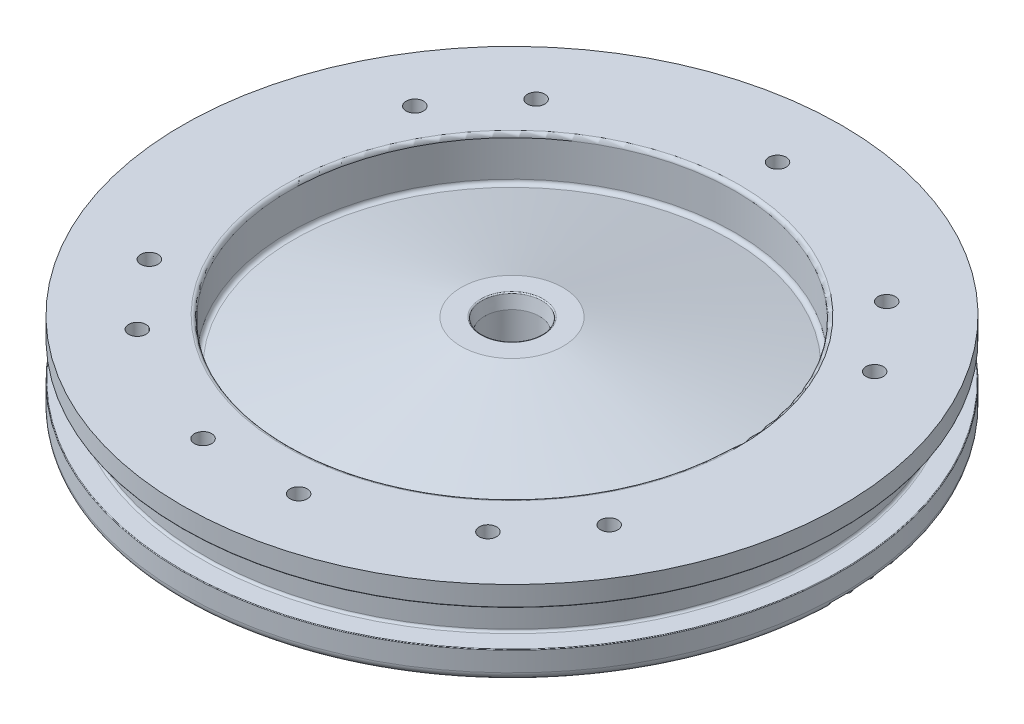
ISO-10303-21;
HEADER;
FILE_DESCRIPTION(('STEP AP214'),'2;1');
FILE_NAME('part.step','',(''),(''),'','','');
FILE_SCHEMA(('AUTOMOTIVE_DESIGN { 1 0 10303 214 1 1 1 1 }'));
ENDSEC;
DATA;
#1=APPLICATION_CONTEXT('core data for automotive mechanical design processes');
#2=APPLICATION_PROTOCOL_DEFINITION('international standard','automotive_design',2000,#1);
#3=PRODUCT_CONTEXT('',#1,'mechanical');
#4=PRODUCT('Part','Part','',(#3));
#5=PRODUCT_RELATED_PRODUCT_CATEGORY('part','',(#4));
#6=PRODUCT_DEFINITION_FORMATION('','',#4);
#7=PRODUCT_DEFINITION_CONTEXT('part definition',#1,'design');
#8=PRODUCT_DEFINITION('design','',#6,#7);
#9=PRODUCT_DEFINITION_SHAPE('','',#8);
#10=(LENGTH_UNIT() NAMED_UNIT(*) SI_UNIT(.MILLI.,.METRE.));
#11=(NAMED_UNIT(*) PLANE_ANGLE_UNIT() SI_UNIT($,.RADIAN.));
#12=(NAMED_UNIT(*) SI_UNIT($,.STERADIAN.) SOLID_ANGLE_UNIT());
#13=UNCERTAINTY_MEASURE_WITH_UNIT(LENGTH_MEASURE(1.E-05),#10,'distance_accuracy_value','');
#14=(GEOMETRIC_REPRESENTATION_CONTEXT(3) GLOBAL_UNCERTAINTY_ASSIGNED_CONTEXT((#13)) GLOBAL_UNIT_ASSIGNED_CONTEXT((#10,
#11,#12)) REPRESENTATION_CONTEXT('',''));
#15=CARTESIAN_POINT('',(0.,0.,0.));
#16=DIRECTION('',(0.,0.,1.));
#17=DIRECTION('',(1.,0.,0.));
#18=AXIS2_PLACEMENT_3D('',#15,#16,#17);
#19=CARTESIAN_POINT('',(0.,-11.34745,0.));
#20=DIRECTION('',(0.,-1.,0.));
#21=DIRECTION('',(0.,0.,-1.));
#22=AXIS2_PLACEMENT_3D('',#19,#20,#21);
#23=TOROIDAL_SURFACE('',#22,65.532,0.127000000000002);
#24=CARTESIAN_POINT('',(0.,-11.34745,0.));
#25=DIRECTION('',(0.,-1.,0.));
#26=DIRECTION('',(0.,0.,-1.));
#27=AXIS2_PLACEMENT_3D('',#24,#25,#26);
#28=CIRCLE('',#27,65.659);
#29=CARTESIAN_POINT('',(0.,-11.34745,-65.659));
#30=VERTEX_POINT('',#29);
#31=EDGE_CURVE('E235',#30,#30,#28,.T.);
#32=ORIENTED_EDGE('',*,*,#31,.F.);
#33=EDGE_LOOP('',(#32));
#34=FACE_BOUND('',#33,.T.);
#35=CARTESIAN_POINT('',(0.,-11.22045,0.));
#36=DIRECTION('',(0.,-1.,0.));
#37=DIRECTION('',(0.,0.,-1.));
#38=AXIS2_PLACEMENT_3D('',#35,#36,#37);
#39=CIRCLE('',#38,65.532);
#40=CARTESIAN_POINT('',(0.,-11.22045,-65.532));
#41=VERTEX_POINT('',#40);
#42=EDGE_CURVE('E191',#41,#41,#39,.T.);
#43=ORIENTED_EDGE('',*,*,#42,.T.);
#44=EDGE_LOOP('',(#43));
#45=FACE_BOUND('',#44,.T.);
#46=ADVANCED_FACE('F45',(#34,#45),#23,.T.);
#47=CARTESIAN_POINT('',(0.,-8.89,0.));
#48=DIRECTION('',(0.,-1.,0.));
#49=DIRECTION('',(0.,0.,-1.));
#50=AXIS2_PLACEMENT_3D('',#47,#48,#49);
#51=CYLINDRICAL_SURFACE('',#50,65.659);
#52=CARTESIAN_POINT('',(0.,-15.24,0.));
#53=DIRECTION('',(0.,-1.,0.));
#54=DIRECTION('',(0.,0.,-1.));
#55=AXIS2_PLACEMENT_3D('',#52,#53,#54);
#56=CIRCLE('',#55,65.659);
#57=CARTESIAN_POINT('',(0.,-15.24,-65.659));
#58=VERTEX_POINT('',#57);
#59=EDGE_CURVE('E231',#58,#58,#56,.T.);
#60=ORIENTED_EDGE('',*,*,#59,.F.);
#61=EDGE_LOOP('',(#60));
#62=FACE_BOUND('',#61,.T.);
#63=ORIENTED_EDGE('',*,*,#31,.T.);
#64=EDGE_LOOP('',(#63));
#65=FACE_BOUND('',#64,.T.);
#66=ADVANCED_FACE('F284',(#62,#65),#51,.T.);
#67=CARTESIAN_POINT('',(0.,-15.24,0.));
#68=DIRECTION('',(0.,-1.,0.));
#69=DIRECTION('',(0.,0.,-1.));
#70=AXIS2_PLACEMENT_3D('',#67,#68,#69);
#71=TOROIDAL_SURFACE('',#70,64.0715,1.5875);
#72=CARTESIAN_POINT('',(0.,-16.8275,0.));
#73=DIRECTION('',(0.,-1.,0.));
#74=DIRECTION('',(0.,0.,-1.));
#75=AXIS2_PLACEMENT_3D('',#72,#73,#74);
#76=CIRCLE('',#75,64.0715);
#77=CARTESIAN_POINT('',(0.,-16.8275,-64.0715));
#78=VERTEX_POINT('',#77);
#79=EDGE_CURVE('E227',#78,#78,#76,.T.);
#80=ORIENTED_EDGE('',*,*,#79,.F.);
#81=EDGE_LOOP('',(#80));
#82=FACE_BOUND('',#81,.T.);
#83=ORIENTED_EDGE('',*,*,#59,.T.);
#84=EDGE_LOOP('',(#83));
#85=FACE_BOUND('',#84,.T.);
#86=ADVANCED_FACE('F290',(#82,#85),#71,.T.);
#87=CARTESIAN_POINT('',(-64.0715,-16.8275,0.));
#88=DIRECTION('',(0.,1.,0.));
#89=DIRECTION('',(0.,0.,1.));
#90=AXIS2_PLACEMENT_3D('',#87,#88,#89);
#91=PLANE('',#90);
#92=CARTESIAN_POINT('',(0.,-16.8275,0.));
#93=DIRECTION('',(0.,-1.,0.));
#94=DIRECTION('',(0.,0.,-1.));
#95=AXIS2_PLACEMENT_3D('',#92,#93,#94);
#96=CIRCLE('',#95,59.309);
#97=CARTESIAN_POINT('',(0.,-16.8275,-59.309));
#98=VERTEX_POINT('',#97);
#99=EDGE_CURVE('E223',#98,#98,#96,.T.);
#100=ORIENTED_EDGE('',*,*,#99,.F.);
#101=EDGE_LOOP('',(#100));
#102=FACE_BOUND('',#101,.T.);
#103=ORIENTED_EDGE('',*,*,#79,.T.);
#104=EDGE_LOOP('',(#103));
#105=FACE_BOUND('',#104,.T.);
#106=ADVANCED_FACE('F298',(#102,#105),#91,.F.);
#107=CARTESIAN_POINT('',(0.,-16.8275,0.));
#108=DIRECTION('',(0.,-1.,0.));
#109=DIRECTION('',(0.,0.,-1.));
#110=AXIS2_PLACEMENT_3D('',#107,#108,#109);
#111=CONICAL_SURFACE('',#110,59.309,1.43775391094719);
#112=CARTESIAN_POINT('',(0.,-9.63360947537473,0.));
#113=DIRECTION('',(0.,-1.,0.));
#114=DIRECTION('',(0.,0.,-1.));
#115=AXIS2_PLACEMENT_3D('',#112,#113,#114);
#116=CIRCLE('',#115,5.55625);
#117=CARTESIAN_POINT('',(0.,-9.63360947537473,-5.55624999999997));
#118=VERTEX_POINT('',#117);
#119=EDGE_CURVE('E49',#118,#118,#116,.F.);
#120=CARTESIAN_POINT('',(0.,-9.63360947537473,-5.55624999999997));
#121=CARTESIAN_POINT('',(0.,-9.70854583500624,-6.11617447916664));
#122=CARTESIAN_POINT('',(0.,-9.78348219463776,-6.67609895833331));
#123=CARTESIAN_POINT('',(0.,-9.93335491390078,-7.79594791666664));
#124=CARTESIAN_POINT('',(0.,-10.0082912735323,-8.35587239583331));
#125=CARTESIAN_POINT('',(0.,-10.1581639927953,-9.47572135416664));
#126=CARTESIAN_POINT('',(0.,-10.2331003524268,-10.0356458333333));
#127=CARTESIAN_POINT('',(0.,-10.3829730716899,-11.1554947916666));
#128=CARTESIAN_POINT('',(0.,-10.4579094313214,-11.7154192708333));
#129=CARTESIAN_POINT('',(0.,-10.6077821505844,-12.8352682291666));
#130=CARTESIAN_POINT('',(0.,-10.6827185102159,-13.3951927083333));
#131=CARTESIAN_POINT('',(0.,-10.8325912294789,-14.5150416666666));
#132=CARTESIAN_POINT('',(0.,-10.9075275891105,-15.0749661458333));
#133=CARTESIAN_POINT('',(0.,-11.0574003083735,-16.1948151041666));
#134=CARTESIAN_POINT('',(0.,-11.132336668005,-16.7547395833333));
#135=CARTESIAN_POINT('',(0.,-11.282209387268,-17.8745885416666));
#136=CARTESIAN_POINT('',(0.,-11.3571457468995,-18.4345130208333));
#137=CARTESIAN_POINT('',(0.,-11.5070184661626,-19.5543619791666));
#138=CARTESIAN_POINT('',(0.,-11.5819548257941,-20.1142864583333));
#139=CARTESIAN_POINT('',(0.,-11.7318275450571,-21.2341354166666));
#140=CARTESIAN_POINT('',(0.,-11.8067639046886,-21.7940598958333));
#141=CARTESIAN_POINT('',(0.,-11.9566366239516,-22.9139088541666));
#142=CARTESIAN_POINT('',(0.,-12.0315729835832,-23.4738333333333));
#143=CARTESIAN_POINT('',(0.,-12.1814457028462,-24.5936822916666));
#144=CARTESIAN_POINT('',(0.,-12.2563820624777,-25.1536067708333));
#145=CARTESIAN_POINT('',(0.,-12.4062547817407,-26.2734557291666));
#146=CARTESIAN_POINT('',(0.,-12.4811911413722,-26.8333802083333));
#147=CARTESIAN_POINT('',(0.,-12.6310638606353,-27.9532291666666));
#148=CARTESIAN_POINT('',(0.,-12.7060002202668,-28.5131536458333));
#149=CARTESIAN_POINT('',(0.,-12.8558729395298,-29.6330026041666));
#150=CARTESIAN_POINT('',(0.,-12.9308092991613,-30.1929270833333));
#151=CARTESIAN_POINT('',(0.,-13.0806820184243,-31.3127760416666));
#152=CARTESIAN_POINT('',(0.,-13.1556183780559,-31.8727005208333));
#153=CARTESIAN_POINT('',(0.,-13.3054910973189,-32.9925494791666));
#154=CARTESIAN_POINT('',(0.,-13.3804274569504,-33.5524739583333));
#155=CARTESIAN_POINT('',(0.,-13.5303001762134,-34.6723229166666));
#156=CARTESIAN_POINT('',(0.,-13.6052365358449,-35.2322473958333));
#157=CARTESIAN_POINT('',(0.,-13.755109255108,-36.3520963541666));
#158=CARTESIAN_POINT('',(0.,-13.8300456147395,-36.9120208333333));
#159=CARTESIAN_POINT('',(0.,-13.9799183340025,-38.0318697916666));
#160=CARTESIAN_POINT('',(0.,-14.054854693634,-38.5917942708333));
#161=CARTESIAN_POINT('',(0.,-14.204727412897,-39.7116432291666));
#162=CARTESIAN_POINT('',(0.,-14.2796637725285,-40.2715677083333));
#163=CARTESIAN_POINT('',(0.,-14.4295364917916,-41.3914166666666));
#164=CARTESIAN_POINT('',(0.,-14.5044728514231,-41.9513411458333));
#165=CARTESIAN_POINT('',(0.,-14.6543455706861,-43.0711901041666));
#166=CARTESIAN_POINT('',(0.,-14.7292819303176,-43.6311145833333));
#167=CARTESIAN_POINT('',(0.,-14.8791546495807,-44.7509635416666));
#168=CARTESIAN_POINT('',(0.,-14.9540910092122,-45.3108880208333));
#169=CARTESIAN_POINT('',(0.,-15.1039637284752,-46.4307369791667));
#170=CARTESIAN_POINT('',(0.,-15.1789000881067,-46.9906614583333));
#171=CARTESIAN_POINT('',(0.,-15.3287728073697,-48.1105104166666));
#172=CARTESIAN_POINT('',(0.,-15.4037091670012,-48.6704348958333));
#173=CARTESIAN_POINT('',(0.,-15.5535818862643,-49.7902838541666));
#174=CARTESIAN_POINT('',(0.,-15.6285182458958,-50.3502083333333));
#175=CARTESIAN_POINT('',(0.,-15.7783909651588,-51.4700572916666));
#176=CARTESIAN_POINT('',(0.,-15.8533273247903,-52.0299817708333));
#177=CARTESIAN_POINT('',(0.,-16.0032000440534,-53.1498307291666));
#178=CARTESIAN_POINT('',(0.,-16.0781364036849,-53.7097552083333));
#179=CARTESIAN_POINT('',(0.,-16.2280091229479,-54.8296041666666));
#180=CARTESIAN_POINT('',(0.,-16.3029454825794,-55.3895286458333));
#181=CARTESIAN_POINT('',(0.,-16.4528182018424,-56.5093776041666));
#182=CARTESIAN_POINT('',(0.,-16.5277545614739,-57.0693020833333));
#183=CARTESIAN_POINT('',(0.,-16.677627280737,-58.1891510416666));
#184=CARTESIAN_POINT('',(0.,-16.7525636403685,-58.7490755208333));
#185=CARTESIAN_POINT('',(0.,-16.8275,-59.309));
#186=B_SPLINE_CURVE_WITH_KNOTS('',3,(#120,#121,#122,#123,#124,#125,#126,#127,#128,#129,#130,
#131,#132,#133,#134,#135,#136,#137,#138,#139,#140,#141,#142,#143,#144,#145,#146,#147,#148,#149,
#150,#151,#152,#153,#154,#155,#156,#157,#158,#159,#160,#161,#162,#163,#164,#165,#166,#167,#168,
#169,#170,#171,#172,#173,#174,#175,#176,#177,#178,#179,#180,#181,#182,#183,#184,#185),
.UNSPECIFIED.,.F.,.F.,(4,2,2,2,2,2,2,2,2,2,2,2,2,2,2,2,2,2,2,2,2,2,2,2,2,2,2,2,2,2,2,2,4),(0.,
1.69475010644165,3.3895002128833,5.08425031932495,6.7790004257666,8.47375053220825,
10.1685006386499,11.8632507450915,13.5580008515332,15.2527509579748,16.9475010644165,
18.6422511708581,20.3370012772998,22.0317513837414,23.7265014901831,25.4212515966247,
27.1160017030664,28.810751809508,30.5055019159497,32.2002520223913,33.895002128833,
35.5897522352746,37.2845023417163,38.9792524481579,40.6740025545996,42.3687526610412,
44.0635027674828,45.7582528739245,47.4530029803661,49.1477530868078,50.8425031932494,
52.5372532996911,54.2320034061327),.UNSPECIFIED.);
#187=EDGE_CURVE('BSEAM302',#118,#98,#186,.T.);
#188=ORIENTED_EDGE('',*,*,#119,.T.);
#189=ORIENTED_EDGE('',*,*,#99,.T.);
#190=ORIENTED_EDGE('',*,*,#187,.T.);
#191=ORIENTED_EDGE('',*,*,#187,.F.);
#192=EDGE_LOOP('',(#188,#190,#189,#191));
#193=FACE_BOUND('',#192,.T.);
#194=ADVANCED_FACE('F302',(#193),#111,.F.);
#195=CARTESIAN_POINT('',(-65.659,0.,0.));
#196=DIRECTION('',(0.,-1.,0.));
#197=DIRECTION('',(0.,0.,-1.));
#198=AXIS2_PLACEMENT_3D('',#195,#196,#197);
#199=PLANE('',#198);
#200=CARTESIAN_POINT('',(34.9250000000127,0.,-39.7262922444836));
#201=DIRECTION('',(0.,1.,0.));
#202=DIRECTION('',(0.,0.,1.));
#203=AXIS2_PLACEMENT_3D('',#200,#201,#202);
#204=CIRCLE('',#203,1.72719999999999);
#205=CARTESIAN_POINT('',(34.9250000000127,0.,-37.9990922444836));
#206=VERTEX_POINT('',#205);
#207=EDGE_CURVE('E86',#206,#206,#204,.T.);
#208=ORIENTED_EDGE('',*,*,#207,.F.);
#209=EDGE_LOOP('',(#208));
#210=FACE_BOUND('',#209,.T.);
#211=CARTESIAN_POINT('',(34.9250000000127,0.,39.7262922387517));
#212=DIRECTION('',(0.,1.,0.));
#213=DIRECTION('',(0.,0.,1.));
#214=AXIS2_PLACEMENT_3D('',#211,#212,#213);
#215=CIRCLE('',#214,1.72719999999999);
#216=CARTESIAN_POINT('',(34.9250000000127,0.,41.4534922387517));
#217=VERTEX_POINT('',#216);
#218=EDGE_CURVE('E85',#217,#217,#215,.T.);
#219=ORIENTED_EDGE('',*,*,#218,.F.);
#220=EDGE_LOOP('',(#219));
#221=FACE_BOUND('',#220,.T.);
#222=CARTESIAN_POINT('',(-34.9249999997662,0.,-39.7262922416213));
#223=DIRECTION('',(0.,1.,0.));
#224=DIRECTION('',(0.,0.,1.));
#225=AXIS2_PLACEMENT_3D('',#222,#223,#224);
#226=CIRCLE('',#225,1.72719999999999);
#227=CARTESIAN_POINT('',(-34.9249999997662,0.,-37.9990922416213));
#228=VERTEX_POINT('',#227);
#229=EDGE_CURVE('E99',#228,#228,#226,.T.);
#230=ORIENTED_EDGE('',*,*,#229,.F.);
#231=EDGE_LOOP('',(#230));
#232=FACE_BOUND('',#231,.T.);
#233=CARTESIAN_POINT('',(-34.9249999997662,0.,39.726292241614));
#234=DIRECTION('',(0.,1.,0.));
#235=DIRECTION('',(0.,0.,1.));
#236=AXIS2_PLACEMENT_3D('',#233,#234,#235);
#237=CIRCLE('',#236,1.72719999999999);
#238=CARTESIAN_POINT('',(-34.9249999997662,0.,41.453492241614));
#239=VERTEX_POINT('',#238);
#240=EDGE_CURVE('E107',#239,#239,#237,.T.);
#241=ORIENTED_EDGE('',*,*,#240,.F.);
#242=EDGE_LOOP('',(#241));
#243=FACE_BOUND('',#242,.T.);
#244=CARTESIAN_POINT('',(-9.52499999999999,0.,52.0308398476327));
#245=DIRECTION('',(0.,1.,0.));
#246=DIRECTION('',(0.,0.,1.));
#247=AXIS2_PLACEMENT_3D('',#244,#245,#246);
#248=CIRCLE('',#247,1.72719999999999);
#249=CARTESIAN_POINT('',(-9.52499999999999,0.,53.7580398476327));
#250=VERTEX_POINT('',#249);
#251=EDGE_CURVE('E115',#250,#250,#248,.T.);
#252=ORIENTED_EDGE('',*,*,#251,.F.);
#253=EDGE_LOOP('',(#252));
#254=FACE_BOUND('',#253,.T.);
#255=CARTESIAN_POINT('',(9.52500000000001,0.,52.0308398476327));
#256=DIRECTION('',(0.,1.,0.));
#257=DIRECTION('',(0.,0.,1.));
#258=AXIS2_PLACEMENT_3D('',#255,#256,#257);
#259=CIRCLE('',#258,1.72719999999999);
#260=CARTESIAN_POINT('',(9.52500000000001,0.,53.7580398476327));
#261=VERTEX_POINT('',#260);
#262=EDGE_CURVE('E123',#261,#261,#259,.T.);
#263=ORIENTED_EDGE('',*,*,#262,.F.);
#264=EDGE_LOOP('',(#263));
#265=FACE_BOUND('',#264,.T.);
#266=CARTESIAN_POINT('',(-45.8088467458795,0.,-26.4477500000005));
#267=DIRECTION('',(0.,1.,0.));
#268=DIRECTION('',(0.,0.,1.));
#269=AXIS2_PLACEMENT_3D('',#266,#267,#268);
#270=CIRCLE('',#269,1.7272);
#271=CARTESIAN_POINT('',(-45.8088467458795,0.,-24.7205500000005));
#272=VERTEX_POINT('',#271);
#273=EDGE_CURVE('E131',#272,#272,#270,.T.);
#274=ORIENTED_EDGE('',*,*,#273,.F.);
#275=EDGE_LOOP('',(#274));
#276=FACE_BOUND('',#275,.T.);
#277=CARTESIAN_POINT('',(-45.80884674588,0.,26.4477499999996));
#278=DIRECTION('',(0.,1.,0.));
#279=DIRECTION('',(0.,0.,1.));
#280=AXIS2_PLACEMENT_3D('',#277,#278,#279);
#281=CIRCLE('',#280,1.7272);
#282=CARTESIAN_POINT('',(-45.80884674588,0.,28.1749499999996));
#283=VERTEX_POINT('',#282);
#284=EDGE_CURVE('E139',#283,#283,#281,.T.);
#285=ORIENTED_EDGE('',*,*,#284,.F.);
#286=EDGE_LOOP('',(#285));
#287=FACE_BOUND('',#286,.T.);
#288=CARTESIAN_POINT('',(45.8088467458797,0.,26.4477500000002));
#289=DIRECTION('',(0.,1.,0.));
#290=DIRECTION('',(0.,0.,1.));
#291=AXIS2_PLACEMENT_3D('',#288,#289,#290);
#292=CIRCLE('',#291,1.7272);
#293=CARTESIAN_POINT('',(45.8088467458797,0.,28.1749500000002));
#294=VERTEX_POINT('',#293);
#295=EDGE_CURVE('E147',#294,#294,#292,.T.);
#296=ORIENTED_EDGE('',*,*,#295,.F.);
#297=EDGE_LOOP('',(#296));
#298=FACE_BOUND('',#297,.T.);
#299=CARTESIAN_POINT('',(45.8088467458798,0.,-26.4477499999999));
#300=DIRECTION('',(0.,1.,0.));
#301=DIRECTION('',(0.,0.,1.));
#302=AXIS2_PLACEMENT_3D('',#299,#300,#301);
#303=CIRCLE('',#302,1.7272);
#304=CARTESIAN_POINT('',(45.8088467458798,0.,-24.7205499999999));
#305=VERTEX_POINT('',#304);
#306=EDGE_CURVE('E155',#305,#305,#303,.T.);
#307=ORIENTED_EDGE('',*,*,#306,.F.);
#308=EDGE_LOOP('',(#307));
#309=FACE_BOUND('',#308,.T.);
#310=CARTESIAN_POINT('',(0.,0.,-52.8955));
#311=DIRECTION('',(0.,1.,0.));
#312=DIRECTION('',(0.,0.,1.));
#313=AXIS2_PLACEMENT_3D('',#310,#311,#312);
#314=CIRCLE('',#313,1.7272);
#315=CARTESIAN_POINT('',(0.,0.,-51.1683));
#316=VERTEX_POINT('',#315);
#317=EDGE_CURVE('E163',#316,#316,#314,.T.);
#318=ORIENTED_EDGE('',*,*,#317,.F.);
#319=EDGE_LOOP('',(#318));
#320=FACE_BOUND('',#319,.T.);
#321=CARTESIAN_POINT('',(0.,0.,0.));
#322=DIRECTION('',(0.,-1.,0.));
#323=DIRECTION('',(0.,0.,-1.));
#324=AXIS2_PLACEMENT_3D('',#321,#322,#323);
#325=CIRCLE('',#324,45.212);
#326=CARTESIAN_POINT('',(0.,0.,-45.212));
#327=VERTEX_POINT('',#326);
#328=EDGE_CURVE('E11',#327,#327,#325,.T.);
#329=ORIENTED_EDGE('',*,*,#328,.T.);
#330=EDGE_LOOP('',(#329));
#331=FACE_BOUND('',#330,.T.);
#332=CARTESIAN_POINT('',(0.,0.,0.));
#333=DIRECTION('',(0.,-1.,0.));
#334=DIRECTION('',(0.,0.,-1.));
#335=AXIS2_PLACEMENT_3D('',#332,#333,#334);
#336=CIRCLE('',#335,65.659);
#337=CARTESIAN_POINT('',(0.,0.,-65.659));
#338=VERTEX_POINT('',#337);
#339=EDGE_CURVE('E219',#338,#338,#336,.T.);
#340=ORIENTED_EDGE('',*,*,#339,.F.);
#341=EDGE_LOOP('',(#340));
#342=FACE_BOUND('',#341,.T.);
#343=ADVANCED_FACE('F306',(#210,#221,#232,#243,#254,#265,#276,#287,#298,#309,#320,#331,#342),
#199,.F.);
#344=CARTESIAN_POINT('',(0.,-8.89,0.));
#345=DIRECTION('',(0.,-1.,0.));
#346=DIRECTION('',(0.,0.,-1.));
#347=AXIS2_PLACEMENT_3D('',#344,#345,#346);
#348=CYLINDRICAL_SURFACE('',#347,65.659);
#349=CARTESIAN_POINT('',(0.,-3.89255,0.));
#350=DIRECTION('',(0.,-1.,0.));
#351=DIRECTION('',(0.,0.,-1.));
#352=AXIS2_PLACEMENT_3D('',#349,#350,#351);
#353=CIRCLE('',#352,65.659);
#354=CARTESIAN_POINT('',(0.,-3.89255,-65.659));
#355=VERTEX_POINT('',#354);
#356=EDGE_CURVE('E215',#355,#355,#353,.T.);
#357=ORIENTED_EDGE('',*,*,#356,.F.);
#358=EDGE_LOOP('',(#357));
#359=FACE_BOUND('',#358,.T.);
#360=ORIENTED_EDGE('',*,*,#339,.T.);
#361=EDGE_LOOP('',(#360));
#362=FACE_BOUND('',#361,.T.);
#363=ADVANCED_FACE('F310',(#359,#362),#348,.T.);
#364=CARTESIAN_POINT('',(0.,-3.89255,0.));
#365=DIRECTION('',(0.,-1.,0.));
#366=DIRECTION('',(0.,0.,-1.));
#367=AXIS2_PLACEMENT_3D('',#364,#365,#366);
#368=TOROIDAL_SURFACE('',#367,65.532,0.127000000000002);
#369=CARTESIAN_POINT('',(0.,-4.01955,0.));
#370=DIRECTION('',(0.,-1.,0.));
#371=DIRECTION('',(0.,0.,-1.));
#372=AXIS2_PLACEMENT_3D('',#369,#370,#371);
#373=CIRCLE('',#372,65.532);
#374=CARTESIAN_POINT('',(0.,-4.01955,-65.532));
#375=VERTEX_POINT('',#374);
#376=EDGE_CURVE('E211',#375,#375,#373,.T.);
#377=ORIENTED_EDGE('',*,*,#376,.F.);
#378=EDGE_LOOP('',(#377));
#379=FACE_BOUND('',#378,.T.);
#380=ORIENTED_EDGE('',*,*,#356,.T.);
#381=EDGE_LOOP('',(#380));
#382=FACE_BOUND('',#381,.T.);
#383=ADVANCED_FACE('F314',(#379,#382),#368,.T.);
#384=CARTESIAN_POINT('',(-61.7855,-4.01955,0.));
#385=DIRECTION('',(0.,1.,0.));
#386=DIRECTION('',(0.,0.,1.));
#387=AXIS2_PLACEMENT_3D('',#384,#385,#386);
#388=PLANE('',#387);
#389=CARTESIAN_POINT('',(0.,-4.01955,0.));
#390=DIRECTION('',(0.,-1.,0.));
#391=DIRECTION('',(0.,0.,-1.));
#392=AXIS2_PLACEMENT_3D('',#389,#390,#391);
#393=CIRCLE('',#392,61.7855);
#394=CARTESIAN_POINT('',(0.,-4.01955,-61.7855));
#395=VERTEX_POINT('',#394);
#396=EDGE_CURVE('E207',#395,#395,#393,.T.);
#397=ORIENTED_EDGE('',*,*,#396,.F.);
#398=EDGE_LOOP('',(#397));
#399=FACE_BOUND('',#398,.T.);
#400=ORIENTED_EDGE('',*,*,#376,.T.);
#401=EDGE_LOOP('',(#400));
#402=FACE_BOUND('',#401,.T.);
#403=ADVANCED_FACE('F318',(#399,#402),#388,.F.);
#404=CARTESIAN_POINT('',(0.,-4.46405,0.));
#405=DIRECTION('',(0.,-1.,0.));
#406=DIRECTION('',(0.,0.,-1.));
#407=AXIS2_PLACEMENT_3D('',#404,#405,#406);
#408=TOROIDAL_SURFACE('',#407,61.7855,0.444500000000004);
#409=CARTESIAN_POINT('',(0.,-4.46405,0.));
#410=DIRECTION('',(0.,-1.,0.));
#411=DIRECTION('',(0.,0.,-1.));
#412=AXIS2_PLACEMENT_3D('',#409,#410,#411);
#413=CIRCLE('',#412,61.341);
#414=CARTESIAN_POINT('',(0.,-4.46405,-61.341));
#415=VERTEX_POINT('',#414);
#416=EDGE_CURVE('E203',#415,#415,#413,.T.);
#417=ORIENTED_EDGE('',*,*,#416,.F.);
#418=EDGE_LOOP('',(#417));
#419=FACE_BOUND('',#418,.T.);
#420=ORIENTED_EDGE('',*,*,#396,.T.);
#421=EDGE_LOOP('',(#420));
#422=FACE_BOUND('',#421,.T.);
#423=ADVANCED_FACE('F322',(#419,#422),#408,.F.);
#424=CARTESIAN_POINT('',(0.,-8.89,0.));
#425=DIRECTION('',(0.,-1.,0.));
#426=DIRECTION('',(0.,0.,-1.));
#427=AXIS2_PLACEMENT_3D('',#424,#425,#426);
#428=CYLINDRICAL_SURFACE('',#427,61.341);
#429=CARTESIAN_POINT('',(0.,-10.77595,0.));
#430=DIRECTION('',(0.,-1.,0.));
#431=DIRECTION('',(0.,0.,-1.));
#432=AXIS2_PLACEMENT_3D('',#429,#430,#431);
#433=CIRCLE('',#432,61.341);
#434=CARTESIAN_POINT('',(0.,-10.77595,-61.341));
#435=VERTEX_POINT('',#434);
#436=EDGE_CURVE('E199',#435,#435,#433,.T.);
#437=ORIENTED_EDGE('',*,*,#436,.F.);
#438=EDGE_LOOP('',(#437));
#439=FACE_BOUND('',#438,.T.);
#440=ORIENTED_EDGE('',*,*,#416,.T.);
#441=EDGE_LOOP('',(#440));
#442=FACE_BOUND('',#441,.T.);
#443=ADVANCED_FACE('F326',(#439,#442),#428,.T.);
#444=CARTESIAN_POINT('',(0.,-10.77595,0.));
#445=DIRECTION('',(0.,-1.,0.));
#446=DIRECTION('',(0.,0.,-1.));
#447=AXIS2_PLACEMENT_3D('',#444,#445,#446);
#448=TOROIDAL_SURFACE('',#447,61.7855,0.444500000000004);
#449=CARTESIAN_POINT('',(0.,-11.22045,0.));
#450=DIRECTION('',(0.,-1.,0.));
#451=DIRECTION('',(0.,0.,-1.));
#452=AXIS2_PLACEMENT_3D('',#449,#450,#451);
#453=CIRCLE('',#452,61.7855);
#454=CARTESIAN_POINT('',(0.,-11.22045,-61.7855));
#455=VERTEX_POINT('',#454);
#456=EDGE_CURVE('E195',#455,#455,#453,.T.);
#457=ORIENTED_EDGE('',*,*,#456,.F.);
#458=EDGE_LOOP('',(#457));
#459=FACE_BOUND('',#458,.T.);
#460=ORIENTED_EDGE('',*,*,#436,.T.);
#461=EDGE_LOOP('',(#460));
#462=FACE_BOUND('',#461,.T.);
#463=ADVANCED_FACE('F330',(#459,#462),#448,.F.);
#464=CARTESIAN_POINT('',(-61.7855,-11.22045,0.));
#465=DIRECTION('',(0.,-1.,0.));
#466=DIRECTION('',(0.,0.,-1.));
#467=AXIS2_PLACEMENT_3D('',#464,#465,#466);
#468=PLANE('',#467);
#469=ORIENTED_EDGE('',*,*,#42,.F.);
#470=EDGE_LOOP('',(#469));
#471=FACE_BOUND('',#470,.T.);
#472=ORIENTED_EDGE('',*,*,#456,.T.);
#473=EDGE_LOOP('',(#472));
#474=FACE_BOUND('',#473,.T.);
#475=ADVANCED_FACE('F262',(#471,#474),#468,.F.);
#476=CARTESIAN_POINT('',(0.,-8.88999999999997,0.));
#477=DIRECTION('',(0.,-1.,0.));
#478=DIRECTION('',(0.,0.,-1.));
#479=AXIS2_PLACEMENT_3D('',#476,#477,#478);
#480=CONICAL_SURFACE('',#479,44.45,1.32407550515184);
#481=CARTESIAN_POINT('',(0.,-8.65121932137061,0.));
#482=DIRECTION('',(0.,-1.,0.));
#483=DIRECTION('',(0.,0.,-1.));
#484=AXIS2_PLACEMENT_3D('',#481,#482,#483);
#485=CIRCLE('',#484,43.5019002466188);
#486=CARTESIAN_POINT('',(0.,-8.65121932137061,-43.5019002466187));
#487=VERTEX_POINT('',#486);
#488=EDGE_CURVE('E239',#487,#487,#485,.F.);
#489=CARTESIAN_POINT('',(0.,-0.254000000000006,0.));
#490=DIRECTION('',(0.,-1.,0.));
#491=DIRECTION('',(0.,0.,-1.));
#492=AXIS2_PLACEMENT_3D('',#489,#490,#491);
#493=CIRCLE('',#492,10.16);
#494=CARTESIAN_POINT('',(0.,-0.254000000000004,-10.16));
#495=VERTEX_POINT('',#494);
#496=EDGE_CURVE('E187',#495,#495,#493,.T.);
#497=CARTESIAN_POINT('',(0.,-8.65121932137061,-43.5019002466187));
#498=CARTESIAN_POINT('',(0.,-8.563748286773,-43.1545887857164));
#499=CARTESIAN_POINT('',(0.,-8.47627725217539,-42.8072773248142));
#500=CARTESIAN_POINT('',(0.,-8.30133518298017,-42.1126544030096));
#501=CARTESIAN_POINT('',(0.,-8.21386414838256,-41.7653429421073));
#502=CARTESIAN_POINT('',(0.,-8.03892207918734,-41.0707200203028));
#503=CARTESIAN_POINT('',(0.,-7.95145104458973,-40.7234085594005));
#504=CARTESIAN_POINT('',(0.,-7.77650897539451,-40.0287856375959));
#505=CARTESIAN_POINT('',(0.,-7.6890379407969,-39.6814741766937));
#506=CARTESIAN_POINT('',(0.,-7.51409587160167,-38.9868512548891));
#507=CARTESIAN_POINT('',(0.,-7.42662483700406,-38.6395397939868));
#508=CARTESIAN_POINT('',(0.,-7.25168276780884,-37.9449168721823));
#509=CARTESIAN_POINT('',(0.,-7.16421173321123,-37.59760541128));
#510=CARTESIAN_POINT('',(0.,-6.98926966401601,-36.9029824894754));
#511=CARTESIAN_POINT('',(0.,-6.9017986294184,-36.5556710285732));
#512=CARTESIAN_POINT('',(0.,-6.72685656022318,-35.8610481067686));
#513=CARTESIAN_POINT('',(0.,-6.63938552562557,-35.5137366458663));
#514=CARTESIAN_POINT('',(0.,-6.46444345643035,-34.8191137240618));
#515=CARTESIAN_POINT('',(0.,-6.37697242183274,-34.4718022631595));
#516=CARTESIAN_POINT('',(0.,-6.20203035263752,-33.7771793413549));
#517=CARTESIAN_POINT('',(0.,-6.11455931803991,-33.4298678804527));
#518=CARTESIAN_POINT('',(0.,-5.93961724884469,-32.7352449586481));
#519=CARTESIAN_POINT('',(0.,-5.85214621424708,-32.3879334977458));
#520=CARTESIAN_POINT('',(0.,-5.67720414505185,-31.6933105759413));
#521=CARTESIAN_POINT('',(0.,-5.58973311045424,-31.345999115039));
#522=CARTESIAN_POINT('',(0.,-5.41479104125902,-30.6513761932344));
#523=CARTESIAN_POINT('',(0.,-5.32732000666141,-30.3040647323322));
#524=CARTESIAN_POINT('',(0.,-5.15237793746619,-29.6094418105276));
#525=CARTESIAN_POINT('',(0.,-5.06490690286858,-29.2621303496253));
#526=CARTESIAN_POINT('',(0.,-4.88996483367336,-28.5675074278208));
#527=CARTESIAN_POINT('',(0.,-4.80249379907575,-28.2201959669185));
#528=CARTESIAN_POINT('',(0.,-4.62755172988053,-27.5255730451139));
#529=CARTESIAN_POINT('',(0.,-4.54008069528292,-27.1782615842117));
#530=CARTESIAN_POINT('',(0.,-4.3651386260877,-26.4836386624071));
#531=CARTESIAN_POINT('',(0.,-4.27766759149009,-26.1363272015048));
#532=CARTESIAN_POINT('',(0.,-4.10272552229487,-25.4417042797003));
#533=CARTESIAN_POINT('',(0.,-4.01525448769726,-25.094392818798));
#534=CARTESIAN_POINT('',(0.,-3.84031241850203,-24.3997698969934));
#535=CARTESIAN_POINT('',(0.,-3.75284138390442,-24.0524584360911));
#536=CARTESIAN_POINT('',(0.,-3.5778993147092,-23.3578355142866));
#537=CARTESIAN_POINT('',(0.,-3.49042828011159,-23.0105240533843));
#538=CARTESIAN_POINT('',(0.,-3.31548621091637,-22.3159011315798));
#539=CARTESIAN_POINT('',(0.,-3.22801517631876,-21.9685896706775));
#540=CARTESIAN_POINT('',(0.,-3.05307310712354,-21.2739667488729));
#541=CARTESIAN_POINT('',(0.,-2.96560207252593,-20.9266552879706));
#542=CARTESIAN_POINT('',(0.,-2.79066000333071,-20.2320323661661));
#543=CARTESIAN_POINT('',(0.,-2.7031889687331,-19.8847209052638));
#544=CARTESIAN_POINT('',(0.,-2.52824689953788,-19.1900979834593));
#545=CARTESIAN_POINT('',(0.,-2.44077586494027,-18.842786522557));
#546=CARTESIAN_POINT('',(0.,-2.26583379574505,-18.1481636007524));
#547=CARTESIAN_POINT('',(0.,-2.17836276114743,-17.8008521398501));
#548=CARTESIAN_POINT('',(0.,-2.00342069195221,-17.1062292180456));
#549=CARTESIAN_POINT('',(0.,-1.9159496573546,-16.7589177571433));
#550=CARTESIAN_POINT('',(0.,-1.74100758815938,-16.0642948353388));
#551=CARTESIAN_POINT('',(0.,-1.65353655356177,-15.7169833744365));
#552=CARTESIAN_POINT('',(0.,-1.47859448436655,-15.0223604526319));
#553=CARTESIAN_POINT('',(0.,-1.39112344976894,-14.6750489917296));
#554=CARTESIAN_POINT('',(0.,-1.21618138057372,-13.9804260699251));
#555=CARTESIAN_POINT('',(0.,-1.12871034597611,-13.6331146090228));
#556=CARTESIAN_POINT('',(0.,-0.953768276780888,-12.9384916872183));
#557=CARTESIAN_POINT('',(0.,-0.866297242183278,-12.591180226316));
#558=CARTESIAN_POINT('',(0.,-0.691355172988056,-11.8965573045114));
#559=CARTESIAN_POINT('',(0.,-0.603884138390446,-11.5492458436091));
#560=CARTESIAN_POINT('',(0.,-0.428942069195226,-10.8546229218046));
#561=CARTESIAN_POINT('',(0.,-0.341471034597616,-10.5073114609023));
#562=CARTESIAN_POINT('',(0.,-0.254000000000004,-10.16));
#563=B_SPLINE_CURVE_WITH_KNOTS('',3,(#497,#498,#499,#500,#501,#502,#503,#504,#505,#506,#507,
#508,#509,#510,#511,#512,#513,#514,#515,#516,#517,#518,#519,#520,#521,#522,#523,#524,#525,#526,
#527,#528,#529,#530,#531,#532,#533,#534,#535,#536,#537,#538,#539,#540,#541,#542,#543,#544,#545,
#546,#547,#548,#549,#550,#551,#552,#553,#554,#555,#556,#557,#558,#559,#560,#561,#562),
.UNSPECIFIED.,.F.,.F.,(4,2,2,2,2,2,2,2,2,2,2,2,2,2,2,2,2,2,2,2,2,2,2,2,2,2,2,2,2,2,2,2,4),(0.,
1.07447098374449,2.14894196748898,3.22341295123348,4.29788393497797,5.37235491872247,
6.44682590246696,7.52129688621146,8.59576786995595,9.67023885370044,10.7447098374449,
11.8191808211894,12.8936518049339,13.9681227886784,15.0425937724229,16.1170647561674,
17.1915357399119,18.2660067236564,19.3404777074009,20.4149486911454,21.4894196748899,
22.5638906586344,23.6383616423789,24.7128326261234,25.7873036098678,26.8617745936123,
27.9362455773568,29.0107165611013,30.0851875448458,31.1596585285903,32.2341295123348,
33.3086004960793,34.3830714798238),.UNSPECIFIED.);
#564=EDGE_CURVE('BSEAM259',#487,#495,#563,.T.);
#565=ORIENTED_EDGE('',*,*,#488,.T.);
#566=ORIENTED_EDGE('',*,*,#496,.T.);
#567=ORIENTED_EDGE('',*,*,#564,.T.);
#568=ORIENTED_EDGE('',*,*,#564,.F.);
#569=EDGE_LOOP('',(#565,#567,#566,#568));
#570=FACE_BOUND('',#569,.T.);
#571=ADVANCED_FACE('F259',(#570),#480,.T.);
#572=CARTESIAN_POINT('',(0.,0.,0.));
#573=DIRECTION('',(0.,1.,0.));
#574=DIRECTION('',(0.,0.,1.));
#575=AXIS2_PLACEMENT_3D('',#572,#573,#574);
#576=CYLINDRICAL_SURFACE('',#575,44.45);
#577=CARTESIAN_POINT('',(0.,-7.91229383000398,0.));
#578=DIRECTION('',(0.,1.,0.));
#579=DIRECTION('',(0.,0.,1.));
#580=AXIS2_PLACEMENT_3D('',#577,#578,#579);
#581=CIRCLE('',#580,44.45);
#582=CARTESIAN_POINT('',(0.,-7.91229383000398,44.45));
#583=VERTEX_POINT('',#582);
#584=EDGE_CURVE('E55',#583,#583,#581,.F.);
#585=ORIENTED_EDGE('',*,*,#584,.T.);
#586=EDGE_LOOP('',(#585));
#587=FACE_BOUND('',#586,.T.);
#588=CARTESIAN_POINT('',(0.,-0.762,0.));
#589=DIRECTION('',(0.,-1.,0.));
#590=DIRECTION('',(0.,0.,-1.));
#591=AXIS2_PLACEMENT_3D('',#588,#589,#590);
#592=CIRCLE('',#591,44.45);
#593=CARTESIAN_POINT('',(0.,-0.762,-44.45));
#594=VERTEX_POINT('',#593);
#595=EDGE_CURVE('E243',#594,#594,#592,.F.);
#596=ORIENTED_EDGE('',*,*,#595,.T.);
#597=EDGE_LOOP('',(#596));
#598=FACE_BOUND('',#597,.T.);
#599=ADVANCED_FACE('F251',(#587,#598),#576,.F.);
#600=CARTESIAN_POINT('',(0.,-7.91229383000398,0.));
#601=DIRECTION('',(0.,1.,0.));
#602=DIRECTION('',(0.,0.,1.));
#603=AXIS2_PLACEMENT_3D('',#600,#601,#602);
#604=TOROIDAL_SURFACE('',#603,43.688,0.762);
#605=ORIENTED_EDGE('',*,*,#584,.F.);
#606=EDGE_LOOP('',(#605));
#607=FACE_BOUND('',#606,.T.);
#608=ORIENTED_EDGE('',*,*,#488,.F.);
#609=EDGE_LOOP('',(#608));
#610=FACE_BOUND('',#609,.T.);
#611=ADVANCED_FACE('F254',(#607,#610),#604,.F.);
#612=CARTESIAN_POINT('',(0.,-0.762,0.));
#613=DIRECTION('',(0.,-1.,0.));
#614=DIRECTION('',(0.,0.,-1.));
#615=AXIS2_PLACEMENT_3D('',#612,#613,#614);
#616=TOROIDAL_SURFACE('',#615,45.212,0.762);
#617=ORIENTED_EDGE('',*,*,#328,.F.);
#618=EDGE_LOOP('',(#617));
#619=FACE_BOUND('',#618,.T.);
#620=ORIENTED_EDGE('',*,*,#595,.F.);
#621=EDGE_LOOP('',(#620));
#622=FACE_BOUND('',#621,.T.);
#623=ADVANCED_FACE('F47',(#619,#622),#616,.T.);
#624=CARTESIAN_POINT('',(0.,0.,0.));
#625=DIRECTION('',(0.,1.,0.));
#626=DIRECTION('',(0.,0.,1.));
#627=AXIS2_PLACEMENT_3D('',#624,#625,#626);
#628=CYLINDRICAL_SURFACE('',#627,5.55625);
#629=CARTESIAN_POINT('',(0.,-2.76441779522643,0.));
#630=DIRECTION('',(0.,1.,0.));
#631=DIRECTION('',(0.,0.,1.));
#632=AXIS2_PLACEMENT_3D('',#629,#630,#631);
#633=CIRCLE('',#632,5.55625);
#634=CARTESIAN_POINT('',(0.,-2.76441779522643,5.55625));
#635=VERTEX_POINT('',#634);
#636=EDGE_CURVE('E171',#635,#635,#633,.T.);
#637=ORIENTED_EDGE('',*,*,#636,.T.);
#638=EDGE_LOOP('',(#637));
#639=FACE_BOUND('',#638,.T.);
#640=ORIENTED_EDGE('',*,*,#119,.F.);
#641=EDGE_LOOP('',(#640));
#642=FACE_BOUND('',#641,.T.);
#643=ADVANCED_FACE('F269',(#639,#642),#628,.F.);
#644=CARTESIAN_POINT('',(-6.22499116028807,-0.254000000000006,-0.0104906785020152));
#645=DIRECTION('',(0.,-1.,0.));
#646=DIRECTION('',(0.,0.,-1.));
#647=AXIS2_PLACEMENT_3D('',#644,#645,#646);
#648=PLANE('',#647);
#649=CARTESIAN_POINT('',(0.,-0.254000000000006,0.));
#650=DIRECTION('',(0.,1.,0.));
#651=DIRECTION('',(0.,0.,1.));
#652=AXIS2_PLACEMENT_3D('',#649,#650,#651);
#653=CIRCLE('',#652,6.225);
#654=CARTESIAN_POINT('',(0.,-0.254000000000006,6.225));
#655=VERTEX_POINT('',#654);
#656=EDGE_CURVE('E183',#655,#655,#653,.T.);
#657=ORIENTED_EDGE('',*,*,#656,.F.);
#658=EDGE_LOOP('',(#657));
#659=FACE_BOUND('',#658,.T.);
#660=ORIENTED_EDGE('',*,*,#496,.F.);
#661=EDGE_LOOP('',(#660));
#662=FACE_BOUND('',#661,.T.);
#663=ADVANCED_FACE('F266',(#659,#662),#648,.F.);
#664=CARTESIAN_POINT('',(0.,-0.508000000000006,0.));
#665=DIRECTION('',(0.,1.,0.));
#666=DIRECTION('',(0.,0.,1.));
#667=AXIS2_PLACEMENT_3D('',#664,#665,#666);
#668=TOROIDAL_SURFACE('',#667,6.225,0.254);
#669=CARTESIAN_POINT('',(0.,-0.455190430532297,0.));
#670=DIRECTION('',(0.,1.,0.));
#671=DIRECTION('',(0.,0.,1.));
#672=AXIS2_PLACEMENT_3D('',#669,#670,#671);
#673=CIRCLE('',#672,5.97655050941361);
#674=CARTESIAN_POINT('',(0.,-0.455190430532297,5.97655050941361));
#675=VERTEX_POINT('',#674);
#676=EDGE_CURVE('E179',#675,#675,#673,.T.);
#677=ORIENTED_EDGE('',*,*,#676,.F.);
#678=EDGE_LOOP('',(#677));
#679=FACE_BOUND('',#678,.T.);
#680=ORIENTED_EDGE('',*,*,#656,.T.);
#681=EDGE_LOOP('',(#680));
#682=FACE_BOUND('',#681,.T.);
#683=ADVANCED_FACE('F268',(#679,#682),#668,.T.);
#684=CARTESIAN_POINT('',(0.,-0.455190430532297,0.));
#685=DIRECTION('',(0.,1.,0.));
#686=DIRECTION('',(0.,0.,1.));
#687=AXIS2_PLACEMENT_3D('',#684,#685,#686);
#688=CONICAL_SURFACE('',#687,5.97655050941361,0.209439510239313);
#689=CARTESIAN_POINT('',(0.,-2.85400000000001,0.));
#690=DIRECTION('',(0.,1.,0.));
#691=DIRECTION('',(0.,0.,1.));
#692=AXIS2_PLACEMENT_3D('',#689,#690,#691);
#693=CIRCLE('',#692,5.46666779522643);
#694=CARTESIAN_POINT('',(0.,-2.85400000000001,5.46666779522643));
#695=VERTEX_POINT('',#694);
#696=EDGE_CURVE('E175',#695,#695,#693,.T.);
#697=ORIENTED_EDGE('',*,*,#696,.F.);
#698=EDGE_LOOP('',(#697));
#699=FACE_BOUND('',#698,.T.);
#700=ORIENTED_EDGE('',*,*,#676,.T.);
#701=EDGE_LOOP('',(#700));
#702=FACE_BOUND('',#701,.T.);
#703=ADVANCED_FACE('F276',(#699,#702),#688,.F.);
#704=CARTESIAN_POINT('',(0.,-2.85400000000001,0.));
#705=DIRECTION('',(0.,1.,0.));
#706=DIRECTION('',(0.,0.,1.));
#707=AXIS2_PLACEMENT_3D('',#704,#705,#706);
#708=CONICAL_SURFACE('',#707,5.46666779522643,0.785398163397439);
#709=ORIENTED_EDGE('',*,*,#636,.F.);
#710=EDGE_LOOP('',(#709));
#711=FACE_BOUND('',#710,.T.);
#712=ORIENTED_EDGE('',*,*,#696,.T.);
#713=EDGE_LOOP('',(#712));
#714=FACE_BOUND('',#713,.T.);
#715=ADVANCED_FACE('F367',(#711,#714),#708,.T.);
#716=CARTESIAN_POINT('',(0.,-10.7188,-52.8955));
#717=DIRECTION('',(0.,-1.,0.));
#718=DIRECTION('',(0.,0.,-1.));
#719=AXIS2_PLACEMENT_3D('',#716,#717,#718);
#720=PLANE('',#719);
#721=CARTESIAN_POINT('',(0.,-10.7188,-52.8955));
#722=DIRECTION('',(0.,1.,0.));
#723=DIRECTION('',(0.,0.,1.));
#724=AXIS2_PLACEMENT_3D('',#721,#722,#723);
#725=CIRCLE('',#724,1.7272);
#726=CARTESIAN_POINT('',(0.,-10.7188,-51.1683));
#727=VERTEX_POINT('',#726);
#728=EDGE_CURVE('E167',#727,#727,#725,.T.);
#729=ORIENTED_EDGE('',*,*,#728,.T.);
#730=EDGE_LOOP('',(#729));
#731=FACE_BOUND('',#730,.T.);
#732=ADVANCED_FACE('F372',(#731),#720,.F.);
#733=CARTESIAN_POINT('',(0.,0.,-52.8955));
#734=DIRECTION('',(0.,1.,0.));
#735=DIRECTION('',(0.,0.,1.));
#736=AXIS2_PLACEMENT_3D('',#733,#734,#735);
#737=CYLINDRICAL_SURFACE('',#736,1.7272);
#738=ORIENTED_EDGE('',*,*,#728,.F.);
#739=EDGE_LOOP('',(#738));
#740=FACE_BOUND('',#739,.T.);
#741=ORIENTED_EDGE('',*,*,#317,.T.);
#742=EDGE_LOOP('',(#741));
#743=FACE_BOUND('',#742,.T.);
#744=ADVANCED_FACE('F398',(#740,#743),#737,.F.);
#745=CARTESIAN_POINT('',(45.8088467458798,-10.7188,-26.4477499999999));
#746=DIRECTION('',(0.,-1.,0.));
#747=DIRECTION('',(0.,0.,-1.));
#748=AXIS2_PLACEMENT_3D('',#745,#746,#747);
#749=PLANE('',#748);
#750=CARTESIAN_POINT('',(45.8088467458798,-10.7188,-26.4477499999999));
#751=DIRECTION('',(0.,1.,0.));
#752=DIRECTION('',(0.,0.,1.));
#753=AXIS2_PLACEMENT_3D('',#750,#751,#752);
#754=CIRCLE('',#753,1.7272);
#755=CARTESIAN_POINT('',(45.8088467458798,-10.7188,-24.7205499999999));
#756=VERTEX_POINT('',#755);
#757=EDGE_CURVE('E159',#756,#756,#754,.T.);
#758=ORIENTED_EDGE('',*,*,#757,.T.);
#759=EDGE_LOOP('',(#758));
#760=FACE_BOUND('',#759,.T.);
#761=ADVANCED_FACE('F403',(#760),#749,.F.);
#762=CARTESIAN_POINT('',(45.8088467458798,0.,-26.4477499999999));
#763=DIRECTION('',(0.,1.,0.));
#764=DIRECTION('',(0.,0.,1.));
#765=AXIS2_PLACEMENT_3D('',#762,#763,#764);
#766=CYLINDRICAL_SURFACE('',#765,1.7272);
#767=ORIENTED_EDGE('',*,*,#757,.F.);
#768=EDGE_LOOP('',(#767));
#769=FACE_BOUND('',#768,.T.);
#770=ORIENTED_EDGE('',*,*,#306,.T.);
#771=EDGE_LOOP('',(#770));
#772=FACE_BOUND('',#771,.T.);
#773=ADVANCED_FACE('F502',(#769,#772),#766,.F.);
#774=CARTESIAN_POINT('',(45.8088467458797,-10.7188,26.4477500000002));
#775=DIRECTION('',(0.,-1.,0.));
#776=DIRECTION('',(0.,0.,-1.));
#777=AXIS2_PLACEMENT_3D('',#774,#775,#776);
#778=PLANE('',#777);
#779=CARTESIAN_POINT('',(45.8088467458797,-10.7188,26.4477500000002));
#780=DIRECTION('',(0.,1.,0.));
#781=DIRECTION('',(0.,0.,1.));
#782=AXIS2_PLACEMENT_3D('',#779,#780,#781);
#783=CIRCLE('',#782,1.7272);
#784=CARTESIAN_POINT('',(45.8088467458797,-10.7188,28.1749500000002));
#785=VERTEX_POINT('',#784);
#786=EDGE_CURVE('E151',#785,#785,#783,.T.);
#787=ORIENTED_EDGE('',*,*,#786,.T.);
#788=EDGE_LOOP('',(#787));
#789=FACE_BOUND('',#788,.T.);
#790=ADVANCED_FACE('F507',(#789),#778,.F.);
#791=CARTESIAN_POINT('',(45.8088467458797,0.,26.4477500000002));
#792=DIRECTION('',(0.,1.,0.));
#793=DIRECTION('',(0.,0.,1.));
#794=AXIS2_PLACEMENT_3D('',#791,#792,#793);
#795=CYLINDRICAL_SURFACE('',#794,1.7272);
#796=ORIENTED_EDGE('',*,*,#786,.F.);
#797=EDGE_LOOP('',(#796));
#798=FACE_BOUND('',#797,.T.);
#799=ORIENTED_EDGE('',*,*,#295,.T.);
#800=EDGE_LOOP('',(#799));
#801=FACE_BOUND('',#800,.T.);
#802=ADVANCED_FACE('F526',(#798,#801),#795,.F.);
#803=CARTESIAN_POINT('',(-45.80884674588,-10.7188,26.4477499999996));
#804=DIRECTION('',(0.,-1.,0.));
#805=DIRECTION('',(0.,0.,-1.));
#806=AXIS2_PLACEMENT_3D('',#803,#804,#805);
#807=PLANE('',#806);
#808=CARTESIAN_POINT('',(-45.80884674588,-10.7188,26.4477499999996));
#809=DIRECTION('',(0.,1.,0.));
#810=DIRECTION('',(0.,0.,1.));
#811=AXIS2_PLACEMENT_3D('',#808,#809,#810);
#812=CIRCLE('',#811,1.7272);
#813=CARTESIAN_POINT('',(-45.80884674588,-10.7188,28.1749499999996));
#814=VERTEX_POINT('',#813);
#815=EDGE_CURVE('E143',#814,#814,#812,.T.);
#816=ORIENTED_EDGE('',*,*,#815,.T.);
#817=EDGE_LOOP('',(#816));
#818=FACE_BOUND('',#817,.T.);
#819=ADVANCED_FACE('F492',(#818),#807,.F.);
#820=CARTESIAN_POINT('',(-45.80884674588,0.,26.4477499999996));
#821=DIRECTION('',(0.,1.,0.));
#822=DIRECTION('',(0.,0.,1.));
#823=AXIS2_PLACEMENT_3D('',#820,#821,#822);
#824=CYLINDRICAL_SURFACE('',#823,1.7272);
#825=ORIENTED_EDGE('',*,*,#815,.F.);
#826=EDGE_LOOP('',(#825));
#827=FACE_BOUND('',#826,.T.);
#828=ORIENTED_EDGE('',*,*,#284,.T.);
#829=EDGE_LOOP('',(#828));
#830=FACE_BOUND('',#829,.T.);
#831=ADVANCED_FACE('F486',(#827,#830),#824,.F.);
#832=CARTESIAN_POINT('',(-45.8088467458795,-10.7188,-26.4477500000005));
#833=DIRECTION('',(0.,-1.,0.));
#834=DIRECTION('',(0.,0.,-1.));
#835=AXIS2_PLACEMENT_3D('',#832,#833,#834);
#836=PLANE('',#835);
#837=CARTESIAN_POINT('',(-45.8088467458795,-10.7188,-26.4477500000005));
#838=DIRECTION('',(0.,1.,0.));
#839=DIRECTION('',(0.,0.,1.));
#840=AXIS2_PLACEMENT_3D('',#837,#838,#839);
#841=CIRCLE('',#840,1.7272);
#842=CARTESIAN_POINT('',(-45.8088467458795,-10.7188,-24.7205500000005));
#843=VERTEX_POINT('',#842);
#844=EDGE_CURVE('E135',#843,#843,#841,.T.);
#845=ORIENTED_EDGE('',*,*,#844,.T.);
#846=EDGE_LOOP('',(#845));
#847=FACE_BOUND('',#846,.T.);
#848=ADVANCED_FACE('F491',(#847),#836,.F.);
#849=CARTESIAN_POINT('',(-45.8088467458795,0.,-26.4477500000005));
#850=DIRECTION('',(0.,1.,0.));
#851=DIRECTION('',(0.,0.,1.));
#852=AXIS2_PLACEMENT_3D('',#849,#850,#851);
#853=CYLINDRICAL_SURFACE('',#852,1.7272);
#854=ORIENTED_EDGE('',*,*,#844,.F.);
#855=EDGE_LOOP('',(#854));
#856=FACE_BOUND('',#855,.T.);
#857=ORIENTED_EDGE('',*,*,#273,.T.);
#858=EDGE_LOOP('',(#857));
#859=FACE_BOUND('',#858,.T.);
#860=ADVANCED_FACE('F515',(#856,#859),#853,.F.);
#861=CARTESIAN_POINT('',(9.52500000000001,-10.7188,52.0308398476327));
#862=DIRECTION('',(0.,1.,0.));
#863=DIRECTION('',(0.,0.,1.));
#864=AXIS2_PLACEMENT_3D('',#861,#862,#863);
#865=CONICAL_SURFACE('',#864,1.7272,1.02974425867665);
#866=CARTESIAN_POINT('',(9.525,-11.7566064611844,52.0308398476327));
#867=VERTEX_POINT('',#866);
#868=VERTEX_LOOP('',#867);
#869=FACE_BOUND('',#868,.T.);
#870=CARTESIAN_POINT('',(9.52500000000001,-10.7188,52.0308398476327));
#871=DIRECTION('',(0.,1.,0.));
#872=DIRECTION('',(0.,0.,1.));
#873=AXIS2_PLACEMENT_3D('',#870,#871,#872);
#874=CIRCLE('',#873,1.7272);
#875=CARTESIAN_POINT('',(9.52500000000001,-10.7188,53.7580398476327));
#876=VERTEX_POINT('',#875);
#877=EDGE_CURVE('E127',#876,#876,#874,.T.);
#878=ORIENTED_EDGE('',*,*,#877,.T.);
#879=EDGE_LOOP('',(#878));
#880=FACE_BOUND('',#879,.T.);
#881=ADVANCED_FACE('F433',(#869,#880),#865,.F.);
#882=CARTESIAN_POINT('',(9.52500000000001,0.,52.0308398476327));
#883=DIRECTION('',(0.,1.,0.));
#884=DIRECTION('',(0.,0.,1.));
#885=AXIS2_PLACEMENT_3D('',#882,#883,#884);
#886=CYLINDRICAL_SURFACE('',#885,1.72719999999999);
#887=ORIENTED_EDGE('',*,*,#877,.F.);
#888=EDGE_LOOP('',(#887));
#889=FACE_BOUND('',#888,.T.);
#890=ORIENTED_EDGE('',*,*,#262,.T.);
#891=EDGE_LOOP('',(#890));
#892=FACE_BOUND('',#891,.T.);
#893=ADVANCED_FACE('F428',(#889,#892),#886,.F.);
#894=CARTESIAN_POINT('',(-9.52499999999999,-10.7188,52.0308398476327));
#895=DIRECTION('',(0.,1.,0.));
#896=DIRECTION('',(0.,0.,1.));
#897=AXIS2_PLACEMENT_3D('',#894,#895,#896);
#898=CONICAL_SURFACE('',#897,1.7272,1.02974425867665);
#899=CARTESIAN_POINT('',(-9.525,-11.7566064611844,52.0308398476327));
#900=VERTEX_POINT('',#899);
#901=VERTEX_LOOP('',#900);
#902=FACE_BOUND('',#901,.T.);
#903=CARTESIAN_POINT('',(-9.52499999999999,-10.7188,52.0308398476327));
#904=DIRECTION('',(0.,1.,0.));
#905=DIRECTION('',(0.,0.,1.));
#906=AXIS2_PLACEMENT_3D('',#903,#904,#905);
#907=CIRCLE('',#906,1.7272);
#908=CARTESIAN_POINT('',(-9.52499999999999,-10.7188,53.7580398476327));
#909=VERTEX_POINT('',#908);
#910=EDGE_CURVE('E119',#909,#909,#907,.T.);
#911=ORIENTED_EDGE('',*,*,#910,.T.);
#912=EDGE_LOOP('',(#911));
#913=FACE_BOUND('',#912,.T.);
#914=ADVANCED_FACE('F418',(#902,#913),#898,.F.);
#915=CARTESIAN_POINT('',(-9.52499999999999,0.,52.0308398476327));
#916=DIRECTION('',(0.,1.,0.));
#917=DIRECTION('',(0.,0.,1.));
#918=AXIS2_PLACEMENT_3D('',#915,#916,#917);
#919=CYLINDRICAL_SURFACE('',#918,1.72719999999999);
#920=ORIENTED_EDGE('',*,*,#910,.F.);
#921=EDGE_LOOP('',(#920));
#922=FACE_BOUND('',#921,.T.);
#923=ORIENTED_EDGE('',*,*,#251,.T.);
#924=EDGE_LOOP('',(#923));
#925=FACE_BOUND('',#924,.T.);
#926=ADVANCED_FACE('F411',(#922,#925),#919,.F.);
#927=CARTESIAN_POINT('',(-34.9249999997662,-10.7188,39.726292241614));
#928=DIRECTION('',(0.,1.,0.));
#929=DIRECTION('',(0.,0.,1.));
#930=AXIS2_PLACEMENT_3D('',#927,#928,#929);
#931=CONICAL_SURFACE('',#930,1.72719999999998,1.02974425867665);
#932=CARTESIAN_POINT('',(-34.9249999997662,-11.7566064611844,39.726292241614));
#933=VERTEX_POINT('',#932);
#934=VERTEX_LOOP('',#933);
#935=FACE_BOUND('',#934,.T.);
#936=CARTESIAN_POINT('',(-34.9249999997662,-10.7188,39.726292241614));
#937=DIRECTION('',(0.,1.,0.));
#938=DIRECTION('',(0.,0.,1.));
#939=AXIS2_PLACEMENT_3D('',#936,#937,#938);
#940=CIRCLE('',#939,1.72719999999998);
#941=CARTESIAN_POINT('',(-34.9249999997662,-10.7188,41.453492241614));
#942=VERTEX_POINT('',#941);
#943=EDGE_CURVE('E111',#942,#942,#940,.T.);
#944=ORIENTED_EDGE('',*,*,#943,.T.);
#945=EDGE_LOOP('',(#944));
#946=FACE_BOUND('',#945,.T.);
#947=ADVANCED_FACE('F417',(#935,#946),#931,.F.);
#948=CARTESIAN_POINT('',(-34.9249999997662,0.,39.726292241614));
#949=DIRECTION('',(0.,1.,0.));
#950=DIRECTION('',(0.,0.,1.));
#951=AXIS2_PLACEMENT_3D('',#948,#949,#950);
#952=CYLINDRICAL_SURFACE('',#951,1.72719999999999);
#953=ORIENTED_EDGE('',*,*,#943,.F.);
#954=EDGE_LOOP('',(#953));
#955=FACE_BOUND('',#954,.T.);
#956=ORIENTED_EDGE('',*,*,#240,.T.);
#957=EDGE_LOOP('',(#956));
#958=FACE_BOUND('',#957,.T.);
#959=ADVANCED_FACE('F475',(#955,#958),#952,.F.);
#960=CARTESIAN_POINT('',(-34.9249999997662,-10.7188,-39.7262922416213));
#961=DIRECTION('',(0.,1.,0.));
#962=DIRECTION('',(0.,0.,1.));
#963=AXIS2_PLACEMENT_3D('',#960,#961,#962);
#964=CONICAL_SURFACE('',#963,1.72719999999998,1.02974425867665);
#965=CARTESIAN_POINT('',(-34.9249999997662,-11.7566064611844,-39.7262922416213));
#966=VERTEX_POINT('',#965);
#967=VERTEX_LOOP('',#966);
#968=FACE_BOUND('',#967,.T.);
#969=CARTESIAN_POINT('',(-34.9249999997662,-10.7188,-39.7262922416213));
#970=DIRECTION('',(0.,1.,0.));
#971=DIRECTION('',(0.,0.,1.));
#972=AXIS2_PLACEMENT_3D('',#969,#970,#971);
#973=CIRCLE('',#972,1.72719999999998);
#974=CARTESIAN_POINT('',(-34.9249999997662,-10.7188,-37.9990922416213));
#975=VERTEX_POINT('',#974);
#976=EDGE_CURVE('E103',#975,#975,#973,.T.);
#977=ORIENTED_EDGE('',*,*,#976,.T.);
#978=EDGE_LOOP('',(#977));
#979=FACE_BOUND('',#978,.T.);
#980=ADVANCED_FACE('F468',(#968,#979),#964,.F.);
#981=CARTESIAN_POINT('',(-34.9249999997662,0.,-39.7262922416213));
#982=DIRECTION('',(0.,1.,0.));
#983=DIRECTION('',(0.,0.,1.));
#984=AXIS2_PLACEMENT_3D('',#981,#982,#983);
#985=CYLINDRICAL_SURFACE('',#984,1.72719999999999);
#986=ORIENTED_EDGE('',*,*,#976,.F.);
#987=EDGE_LOOP('',(#986));
#988=FACE_BOUND('',#987,.T.);
#989=ORIENTED_EDGE('',*,*,#229,.T.);
#990=EDGE_LOOP('',(#989));
#991=FACE_BOUND('',#990,.T.);
#992=ADVANCED_FACE('F463',(#988,#991),#985,.F.);
#993=CARTESIAN_POINT('',(34.9250000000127,-10.7188,39.7262922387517));
#994=DIRECTION('',(0.,1.,0.));
#995=DIRECTION('',(0.,0.,1.));
#996=AXIS2_PLACEMENT_3D('',#993,#994,#995);
#997=CONICAL_SURFACE('',#996,1.72719999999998,1.02974425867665);
#998=CARTESIAN_POINT('',(34.9250000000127,-11.7566064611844,39.7262922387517));
#999=VERTEX_POINT('',#998);
#1000=VERTEX_LOOP('',#999);
#1001=FACE_BOUND('',#1000,.T.);
#1002=CARTESIAN_POINT('',(34.9250000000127,-10.7188,39.7262922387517));
#1003=DIRECTION('',(0.,1.,0.));
#1004=DIRECTION('',(0.,0.,1.));
#1005=AXIS2_PLACEMENT_3D('',#1002,#1003,#1004);
#1006=CIRCLE('',#1005,1.72719999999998);
#1007=CARTESIAN_POINT('',(34.9250000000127,-10.7188,41.4534922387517));
#1008=VERTEX_POINT('',#1007);
#1009=EDGE_CURVE('E91',#1008,#1008,#1006,.T.);
#1010=ORIENTED_EDGE('',*,*,#1009,.T.);
#1011=EDGE_LOOP('',(#1010));
#1012=FACE_BOUND('',#1011,.T.);
#1013=ADVANCED_FACE('F455',(#1001,#1012),#997,.F.);
#1014=CARTESIAN_POINT('',(34.9250000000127,0.,39.7262922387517));
#1015=DIRECTION('',(0.,1.,0.));
#1016=DIRECTION('',(0.,0.,1.));
#1017=AXIS2_PLACEMENT_3D('',#1014,#1015,#1016);
#1018=CYLINDRICAL_SURFACE('',#1017,1.72719999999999);
#1019=ORIENTED_EDGE('',*,*,#1009,.F.);
#1020=EDGE_LOOP('',(#1019));
#1021=FACE_BOUND('',#1020,.T.);
#1022=ORIENTED_EDGE('',*,*,#218,.T.);
#1023=EDGE_LOOP('',(#1022));
#1024=FACE_BOUND('',#1023,.T.);
#1025=ADVANCED_FACE('F78',(#1021,#1024),#1018,.F.);
#1026=CARTESIAN_POINT('',(34.9250000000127,-10.7188,-39.7262922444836));
#1027=DIRECTION('',(0.,1.,0.));
#1028=DIRECTION('',(0.,0.,1.));
#1029=AXIS2_PLACEMENT_3D('',#1026,#1027,#1028);
#1030=CONICAL_SURFACE('',#1029,1.72719999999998,1.02974425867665);
#1031=CARTESIAN_POINT('',(34.9250000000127,-11.7566064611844,-39.7262922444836));
#1032=VERTEX_POINT('',#1031);
#1033=VERTEX_LOOP('',#1032);
#1034=FACE_BOUND('',#1033,.T.);
#1035=CARTESIAN_POINT('',(34.9250000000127,-10.7188,-39.7262922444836));
#1036=DIRECTION('',(0.,1.,0.));
#1037=DIRECTION('',(0.,0.,1.));
#1038=AXIS2_PLACEMENT_3D('',#1035,#1036,#1037);
#1039=CIRCLE('',#1038,1.72719999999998);
#1040=CARTESIAN_POINT('',(34.9250000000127,-10.7188,-37.9990922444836));
#1041=VERTEX_POINT('',#1040);
#1042=EDGE_CURVE('E82',#1041,#1041,#1039,.T.);
#1043=ORIENTED_EDGE('',*,*,#1042,.T.);
#1044=EDGE_LOOP('',(#1043));
#1045=FACE_BOUND('',#1044,.T.);
#1046=ADVANCED_FACE('F74',(#1034,#1045),#1030,.F.);
#1047=CARTESIAN_POINT('',(34.9250000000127,0.,-39.7262922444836));
#1048=DIRECTION('',(0.,1.,0.));
#1049=DIRECTION('',(0.,0.,1.));
#1050=AXIS2_PLACEMENT_3D('',#1047,#1048,#1049);
#1051=CYLINDRICAL_SURFACE('',#1050,1.72719999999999);
#1052=ORIENTED_EDGE('',*,*,#1042,.F.);
#1053=EDGE_LOOP('',(#1052));
#1054=FACE_BOUND('',#1053,.T.);
#1055=ORIENTED_EDGE('',*,*,#207,.T.);
#1056=EDGE_LOOP('',(#1055));
#1057=FACE_BOUND('',#1056,.T.);
#1058=ADVANCED_FACE('F77',(#1054,#1057),#1051,.F.);
#1059=CLOSED_SHELL('',(#46,#66,#86,#106,#194,#343,#363,#383,#403,#423,#443,#463,#475,#571,#599,
#611,#623,#643,#663,#683,#703,#715,#732,#744,#761,#773,#790,#802,#819,#831,#848,#860,#881,#893,
#914,#926,#947,#959,#980,#992,#1013,#1025,#1046,#1058));
#1060=MANIFOLD_SOLID_BREP('B2',#1059);
#1061=ADVANCED_BREP_SHAPE_REPRESENTATION('',(#18,#1060),#14);
#1062=SHAPE_DEFINITION_REPRESENTATION(#9,#1061);
ENDSEC;
END-ISO-10303-21;
